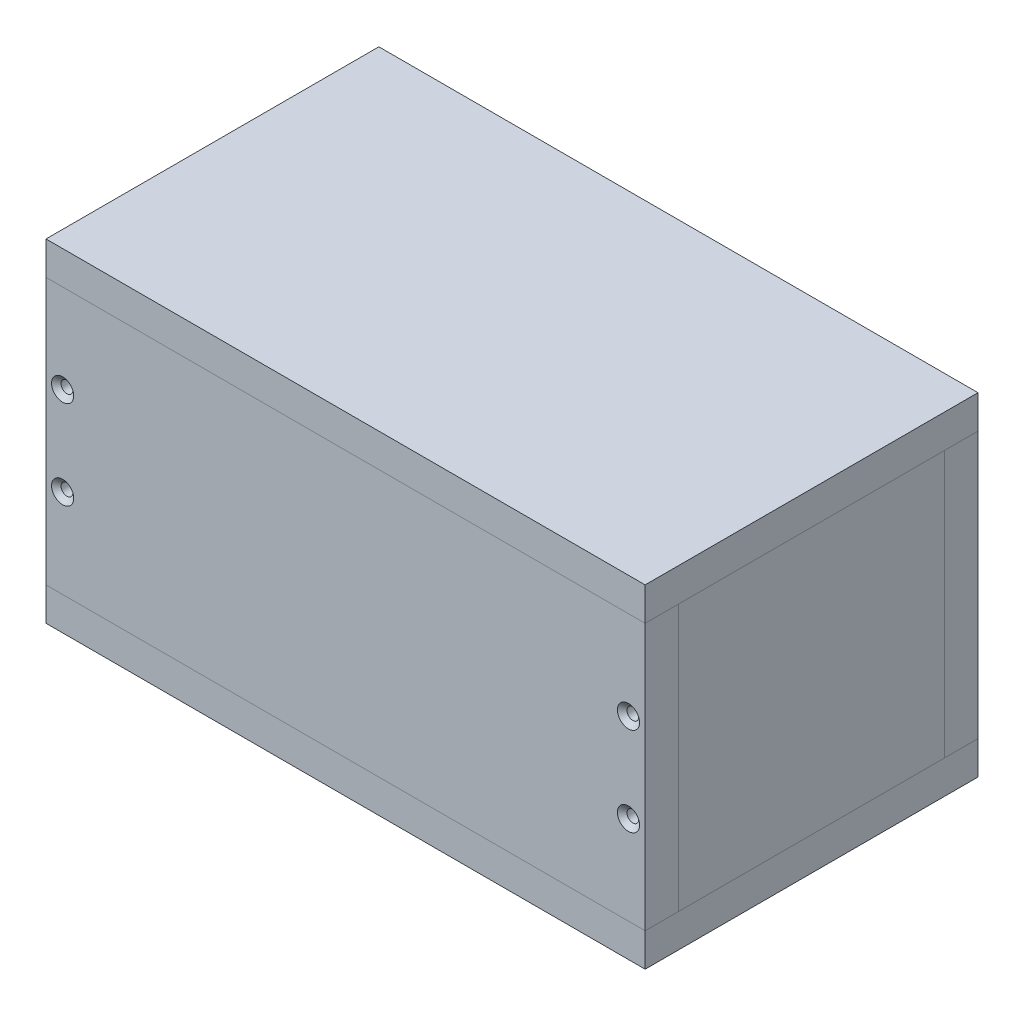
from build123d import *

# Parameters (mm, degrees)
SKETCH2_W                                   = 228.6
SKETCH2_H                                   = 12.7
BOSS_EXTRUDE1_DEPTH                         = 101.6
BOSS_EXTRUDE1_2_DEPTH                       = 101.6
SKETCH3_W                                   = 12.7
SKETCH3_H                                   = 101.6
BOSS_EXTRUDE2_DEPTH                         = 101.6
BOSS_EXTRUDE2_2_DEPTH                       = 101.6
SKETCH4_W                                   = 228.6
SKETCH4_H                                   = 127
BOSS_EXTRUDE3_DEPTH                         = 12.7
SKETCH6_W                                   = 228.6
SKETCH6_H                                   = 127
BOSS_EXTRUDE4_DEPTH                         = 12.7
CSK_FOR_8_FLAT_HEAD_MACHINE_SCREW_2_COUNT   = 2
CSK_FOR_8_FLAT_HEAD_MACHINE_SCREW_2_PITCH   = 33.866666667
CSK_FOR_8_FLAT_HEAD_MACHINE_SCREW_3_COUNT   = 2
CSK_FOR_8_FLAT_HEAD_MACHINE_SCREW_3_PITCH   = 215.9
CSK_FOR_8_FLAT_HEAD_MACHINE_SCREW_4_COUNT   = 2
CSK_FOR_8_FLAT_HEAD_MACHINE_SCREW_4_PITCH   = 218.540067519
CSK_FOR_8_FLAT_HEAD_MACHINE_SCREW_5_A_COUNT = 2
CSK_FOR_8_FLAT_HEAD_MACHINE_SCREW_5_A_PITCH = 114.3
CSK_FOR_8_FLAT_HEAD_MACHINE_SCREW_6_COUNT   = 2
CSK_FOR_8_FLAT_HEAD_MACHINE_SCREW_6_PITCH   = 161.644610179
CSK_FOR_8_FLAT_HEAD_MACHINE_SCREW_7_COUNT   = 2
CSK_FOR_8_FLAT_HEAD_MACHINE_SCREW_7_PITCH   = 114.3
BOSS_EXTRUDE5_REACH                         = 175.67
SKETCH12_W                                  = 12.7
SKETCH12_H                                  = 101.6
BOSS_EXTRUDE6_REACH                         = 175.67
BOSS_EXTRUDE8_DEPTH                         = 12.7


with BuildPart() as part:
    # Sketch2 → Boss-Extrude1 (new body)
    with BuildSketch(Plane(origin=(0, 0, 0), x_dir=(1, 0, 0), z_dir=(0, 1, 0))):
        with Locations((0, 57.15)):
            Rectangle(SKETCH2_W, SKETCH2_H)
    extrude(amount=BOSS_EXTRUDE1_DEPTH)


with BuildPart() as body_2:
    # Sketch2 → Boss-Extrude1 2 (new body)
    with BuildSketch(Plane(origin=(0, 0, 0), x_dir=(1, 0, 0), z_dir=(0, 1, 0))):
        with Locations((0, -57.15)):
            Rectangle(SKETCH2_W, SKETCH2_H)
    extrude(amount=BOSS_EXTRUDE1_2_DEPTH)


with BuildPart() as body_3:
    # Sketch3 → Boss-Extrude2 (new body)
    with BuildSketch(Plane(origin=(0, 0, 0), x_dir=(1, 0, 0), z_dir=(0, 1, 0))):
        with Locations((107.95, 0)):
            Rectangle(SKETCH3_W, SKETCH3_H)
    extrude(amount=BOSS_EXTRUDE2_DEPTH)


with BuildPart() as body_4:
    # Sketch3 → Boss-Extrude2 2 (new body)
    with BuildSketch(Plane(origin=(0, 0, 0), x_dir=(1, 0, 0), z_dir=(0, 1, 0))):
        with Locations((-107.95, 0)):
            Rectangle(SKETCH3_W, SKETCH3_H)
    extrude(amount=BOSS_EXTRUDE2_2_DEPTH)


with BuildPart() as body_5:
    # Sketch4 → Boss-Extrude3 (new body)
    with BuildSketch(Plane(origin=(0, 0, 0), x_dir=(1, 0, 0), z_dir=(0, 1, 0))):
        Rectangle(SKETCH4_W, SKETCH4_H)
    extrude(amount=-BOSS_EXTRUDE3_DEPTH)


with BuildPart() as body_6:
    # Sketch6 → Boss-Extrude4 (new body)
    with BuildSketch(Plane(origin=(0, 101.6, 0), x_dir=(1, 0, 0), z_dir=(0, 1, 0))):
        Rectangle(SKETCH6_W, SKETCH6_H)
    extrude(amount=BOSS_EXTRUDE4_DEPTH)


with BuildPart() as csk_for_8_flat_head_machine_screw_100_tool:
    # Sketch8 → CSK for _8 Flat Head Machine Screw _100 (revolve)
    with BuildSketch(Plane(origin=(-107.95, 67.733333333, 63.5), x_dir=(0, -1, 0), z_dir=(1, 0, 0))):
        Polygon((0, 0), (0, 31.322674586), (2.2479, 29.972), (2.2479, 1.651767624), (4.2164, 0), align=None)
    csk_for_8_flat_head_machine_screw_100 = revolve(axis=Axis((-107.95, 67.733333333, 69.85), (0, 0, -1)))


with BuildPart() as body_2_1:
    add(body_2.part)

    # CSK for _8 Flat Head Machine Screw _100: cut by csk_for_8_flat_head_machine_screw_100_tool
    add(csk_for_8_flat_head_machine_screw_100_tool.part, mode=Mode.SUBTRACT)


with BuildPart() as body_4_1:
    add(body_4.part)

    # CSK for _8 Flat Head Machine Screw _100: cut by csk_for_8_flat_head_machine_screw_100_tool
    add(csk_for_8_flat_head_machine_screw_100_tool.part, mode=Mode.SUBTRACT)


with BuildPart() as csk_for_8_flat_head_machine_screw_2_tool:
    # CSK for _8 Flat Head Machine Screw _ 2: CSK for _8 Flat Head Machine Screw _100 ×2
    with Locations(*[(0, -i * CSK_FOR_8_FLAT_HEAD_MACHINE_SCREW_2_PITCH, 0) for i in range(1, CSK_FOR_8_FLAT_HEAD_MACHINE_SCREW_2_COUNT)]):
        add(csk_for_8_flat_head_machine_screw_100)


with BuildPart() as body_2_2:
    add(body_2_1.part)

    # CSK for _8 Flat Head Machine Screw _ 2: cut by csk_for_8_flat_head_machine_screw_2_tool
    add(csk_for_8_flat_head_machine_screw_2_tool.part, mode=Mode.SUBTRACT)


with BuildPart() as body_4_2:
    add(body_4_1.part)

    # CSK for _8 Flat Head Machine Screw _ 2: cut by csk_for_8_flat_head_machine_screw_2_tool
    add(csk_for_8_flat_head_machine_screw_2_tool.part, mode=Mode.SUBTRACT)


with BuildPart() as csk_for_8_flat_head_machine_screw_3_tool:
    # CSK for _8 Flat Head Machine Screw _ 3: CSK for _8 Flat Head Machine Screw _100 ×2
    with Locations(*[(i * CSK_FOR_8_FLAT_HEAD_MACHINE_SCREW_3_PITCH, 0, 0) for i in range(1, CSK_FOR_8_FLAT_HEAD_MACHINE_SCREW_3_COUNT)]):
        add(csk_for_8_flat_head_machine_screw_100)


with BuildPart() as body_2_3:
    add(body_2_2.part)

    # CSK for _8 Flat Head Machine Screw _ 3: cut by csk_for_8_flat_head_machine_screw_3_tool
    add(csk_for_8_flat_head_machine_screw_3_tool.part, mode=Mode.SUBTRACT)


with BuildPart() as body_3_1:
    add(body_3.part)

    # CSK for _8 Flat Head Machine Screw _ 3: cut by csk_for_8_flat_head_machine_screw_3_tool
    add(csk_for_8_flat_head_machine_screw_3_tool.part, mode=Mode.SUBTRACT)


with BuildPart() as csk_for_8_flat_head_machine_screw_4_tool:
    # CSK for _8 Flat Head Machine Screw _ 4: CSK for _8 Flat Head Machine Screw _100 ×2
    with Locations(*[Vector(0.9879195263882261, -0.15496776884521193, 0) * (i * CSK_FOR_8_FLAT_HEAD_MACHINE_SCREW_4_PITCH) for i in range(1, CSK_FOR_8_FLAT_HEAD_MACHINE_SCREW_4_COUNT)]):
        add(csk_for_8_flat_head_machine_screw_100)


with BuildPart() as body_2_4:
    add(body_2_3.part)

    # CSK for _8 Flat Head Machine Screw _ 4: cut by csk_for_8_flat_head_machine_screw_4_tool
    add(csk_for_8_flat_head_machine_screw_4_tool.part, mode=Mode.SUBTRACT)


with BuildPart() as body_3_2:
    add(body_3_1.part)

    # CSK for _8 Flat Head Machine Screw _ 4: cut by csk_for_8_flat_head_machine_screw_4_tool
    add(csk_for_8_flat_head_machine_screw_4_tool.part, mode=Mode.SUBTRACT)


with BuildPart() as mirror1_tool:
    # Mirror1: CSK for _8 Flat Head Machine Screw _100 across plane
    add(csk_for_8_flat_head_machine_screw_100.mirror(Plane.XY))


with BuildPart() as part_1:
    add(part.part)

    # Mirror1: cut by mirror1_tool
    add(mirror1_tool.part, mode=Mode.SUBTRACT)


with BuildPart() as body_4_3:
    add(body_4_2.part)

    # Mirror1: cut by mirror1_tool
    add(mirror1_tool.part, mode=Mode.SUBTRACT)


with BuildPart() as mirror1_copy_1_tool:
    # Mirror1 copy 1 sketch → Mirror1 copy 1 (revolve)
    with BuildSketch(Plane(origin=(-107.95, 33.866666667, -63.5), x_dir=(0, -1, 0), z_dir=(1, 0, 0))):
        Polygon((0, 0), (0, -31.322674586), (2.2479, -29.972), (2.2479, -1.651767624), (4.2164, 0), align=None)
    revolve(axis=Axis((-107.95, 33.866666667, -69.85), (0, 0, -1)))


with BuildPart() as part_2:
    add(part_1.part)

    # Mirror1 copy 1: cut by mirror1_copy_1_tool
    add(mirror1_copy_1_tool.part, mode=Mode.SUBTRACT)


with BuildPart() as body_4_4:
    add(body_4_3.part)

    # Mirror1 copy 1: cut by mirror1_copy_1_tool
    add(mirror1_copy_1_tool.part, mode=Mode.SUBTRACT)


with BuildPart() as mirror1_copy_2_tool:
    # Mirror1 copy 2 sketch → Mirror1 copy 2 (revolve)
    with BuildSketch(Plane(origin=(107.95, 67.733333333, -63.5), x_dir=(0, -1, 0), z_dir=(1, 0, 0))):
        Polygon((0, 0), (0, -31.322674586), (2.2479, -29.972), (2.2479, -1.651767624), (4.2164, 0), align=None)
    revolve(axis=Axis((107.95, 67.733333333, -69.85), (0, 0, -1)))


with BuildPart() as part_3:
    add(part_2.part)

    # Mirror1 copy 2: cut by mirror1_copy_2_tool
    add(mirror1_copy_2_tool.part, mode=Mode.SUBTRACT)


with BuildPart() as body_3_3:
    add(body_3_2.part)

    # Mirror1 copy 2: cut by mirror1_copy_2_tool
    add(mirror1_copy_2_tool.part, mode=Mode.SUBTRACT)


with BuildPart() as mirror1_copy_3_tool:
    # Mirror1 copy 3 sketch → Mirror1 copy 3 (revolve)
    with BuildSketch(Plane(origin=(107.95, 33.866666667, -63.5), x_dir=(0, -1, 0), z_dir=(1, 0, 0))):
        Polygon((0, 0), (0, -31.322674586), (2.2479, -29.972), (2.2479, -1.651767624), (4.2164, 0), align=None)
    revolve(axis=Axis((107.95, 33.866666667, -69.85), (0, 0, -1)))


with BuildPart() as part_4:
    add(part_3.part)

    # Mirror1 copy 3: cut by mirror1_copy_3_tool
    add(mirror1_copy_3_tool.part, mode=Mode.SUBTRACT)


with BuildPart() as body_3_4:
    add(body_3_3.part)

    # Mirror1 copy 3: cut by mirror1_copy_3_tool
    add(mirror1_copy_3_tool.part, mode=Mode.SUBTRACT)


with BuildPart() as csk_for_8_flat_head_machine_screw_5_tool:
    # Sketch11 → CSK for _8 Flat Head Machine Screw _ 5 (revolve)
    with BuildSketch(Plane(origin=(57.15, -12.7, -57.15), x_dir=(0, 0, -1), z_dir=(1, 0, 0))):
        Polygon((0, 0), (0, 31.322674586), (2.2479, 29.972), (2.2479, 1.651767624), (4.2164, 0), align=None)
    csk_for_8_flat_head_machine_screw_5 = revolve(axis=Axis((57.15, -19.05, -57.15), (0, 1, 0)))


with BuildPart() as part_5:
    add(part_4.part)

    # CSK for _8 Flat Head Machine Screw _ 5: cut by csk_for_8_flat_head_machine_screw_5_tool
    add(csk_for_8_flat_head_machine_screw_5_tool.part, mode=Mode.SUBTRACT)


with BuildPart() as body_5_1:
    add(body_5.part)

    # CSK for _8 Flat Head Machine Screw _ 5: cut by csk_for_8_flat_head_machine_screw_5_tool
    add(csk_for_8_flat_head_machine_screw_5_tool.part, mode=Mode.SUBTRACT)


with BuildPart() as csk_for_8_flat_head_machine_screw_5_a_tool:
    # CSK for _8 Flat Head Machine Screw _ 5 a: CSK for _8 Flat Head Machine Screw _ 5 ×2
    with Locations(*[(-i * CSK_FOR_8_FLAT_HEAD_MACHINE_SCREW_5_A_PITCH, 0, 0) for i in range(1, CSK_FOR_8_FLAT_HEAD_MACHINE_SCREW_5_A_COUNT)]):
        add(csk_for_8_flat_head_machine_screw_5)


with BuildPart() as part_6:
    add(part_5.part)

    # CSK for _8 Flat Head Machine Screw _ 5 a: cut by csk_for_8_flat_head_machine_screw_5_a_tool
    add(csk_for_8_flat_head_machine_screw_5_a_tool.part, mode=Mode.SUBTRACT)


with BuildPart() as body_5_2:
    add(body_5_1.part)

    # CSK for _8 Flat Head Machine Screw _ 5 a: cut by csk_for_8_flat_head_machine_screw_5_a_tool
    add(csk_for_8_flat_head_machine_screw_5_a_tool.part, mode=Mode.SUBTRACT)


with BuildPart() as csk_for_8_flat_head_machine_screw_6_tool:
    # CSK for _8 Flat Head Machine Screw _ 6: CSK for _8 Flat Head Machine Screw _ 5 ×2
    with Locations(*[Vector(-0.7071067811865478, 0, 0.7071067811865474) * (i * CSK_FOR_8_FLAT_HEAD_MACHINE_SCREW_6_PITCH) for i in range(1, CSK_FOR_8_FLAT_HEAD_MACHINE_SCREW_6_COUNT)]):
        add(csk_for_8_flat_head_machine_screw_5)


with BuildPart() as body_2_5:
    add(body_2_4.part)

    # CSK for _8 Flat Head Machine Screw _ 6: cut by csk_for_8_flat_head_machine_screw_6_tool
    add(csk_for_8_flat_head_machine_screw_6_tool.part, mode=Mode.SUBTRACT)


with BuildPart() as body_5_3:
    add(body_5_2.part)

    # CSK for _8 Flat Head Machine Screw _ 6: cut by csk_for_8_flat_head_machine_screw_6_tool
    add(csk_for_8_flat_head_machine_screw_6_tool.part, mode=Mode.SUBTRACT)


with BuildPart() as csk_for_8_flat_head_machine_screw_7_tool:
    # CSK for _8 Flat Head Machine Screw _ 7: CSK for _8 Flat Head Machine Screw _ 5 ×2
    with Locations(*[(0, 0, i * CSK_FOR_8_FLAT_HEAD_MACHINE_SCREW_7_PITCH) for i in range(1, CSK_FOR_8_FLAT_HEAD_MACHINE_SCREW_7_COUNT)]):
        add(csk_for_8_flat_head_machine_screw_5)


with BuildPart() as body_2_6:
    add(body_2_5.part)

    # CSK for _8 Flat Head Machine Screw _ 7: cut by csk_for_8_flat_head_machine_screw_7_tool
    add(csk_for_8_flat_head_machine_screw_7_tool.part, mode=Mode.SUBTRACT)


with BuildPart() as body_5_4:
    add(body_5_3.part)

    # CSK for _8 Flat Head Machine Screw _ 7: cut by csk_for_8_flat_head_machine_screw_7_tool
    add(csk_for_8_flat_head_machine_screw_7_tool.part, mode=Mode.SUBTRACT)


with BuildPart() as body_7:

    # Sketch12 → Boss-Extrude5 (new, up to next)
    with BuildSketch(Plane(origin=(0, 101.6, 0), x_dir=(1, 0, 0), z_dir=(0, 1, 0)), mode=Mode.PRIVATE) as boss_extrude5_sk1:
        with Locations((69.85, 0)):
            Rectangle(SKETCH12_W, SKETCH12_H)
    boss_extrude5_tool1 = extrude(boss_extrude5_sk1.sketch, amount=-BOSS_EXTRUDE5_REACH, mode=Mode.PRIVATE) - body_5_4.part
    add(boss_extrude5_tool1.solids().sort_by_distance((69.85, 101.6, 0))[0])


with BuildPart() as body_8:

    # Sketch13 → Boss-Extrude6 (new, up to next)
    with BuildSketch(Plane(origin=(0, 101.6, 0), x_dir=(1, 0, 0), z_dir=(0, 1, 0)), mode=Mode.PRIVATE) as boss_extrude6_sk1:
        Polygon((-43.360512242, 50.8), (-101.6, -7.439487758), (-101.6, -25.4), (-25.4, 50.8), align=None)
    boss_extrude6_tool1 = extrude(boss_extrude6_sk1.sketch, amount=-BOSS_EXTRUDE6_REACH, mode=Mode.PRIVATE) - body_5_4.part
    add(boss_extrude6_tool1.solids().sort_by_distance((-67.790174, 101.6, -16.990174))[0])


with BuildPart() as body_9:
    # Sketch14 → Boss-Extrude8 (new body)
    with BuildSketch(Plane(origin=(0, 0, 0), x_dir=(1, 0, 0), z_dir=(0, 1, 0))):
        Polygon((-19.05, -25.4), (-44.45, -50.8), (31.75, -50.8), (31.75, -25.4), align=None)
    extrude(amount=BOSS_EXTRUDE8_DEPTH)


solid = Compound([body_6.part, body_4_4.part, body_3_4.part, part_6.part, body_2_6.part, body_5_4.part, body_7.part, body_8.part, body_9.part])
